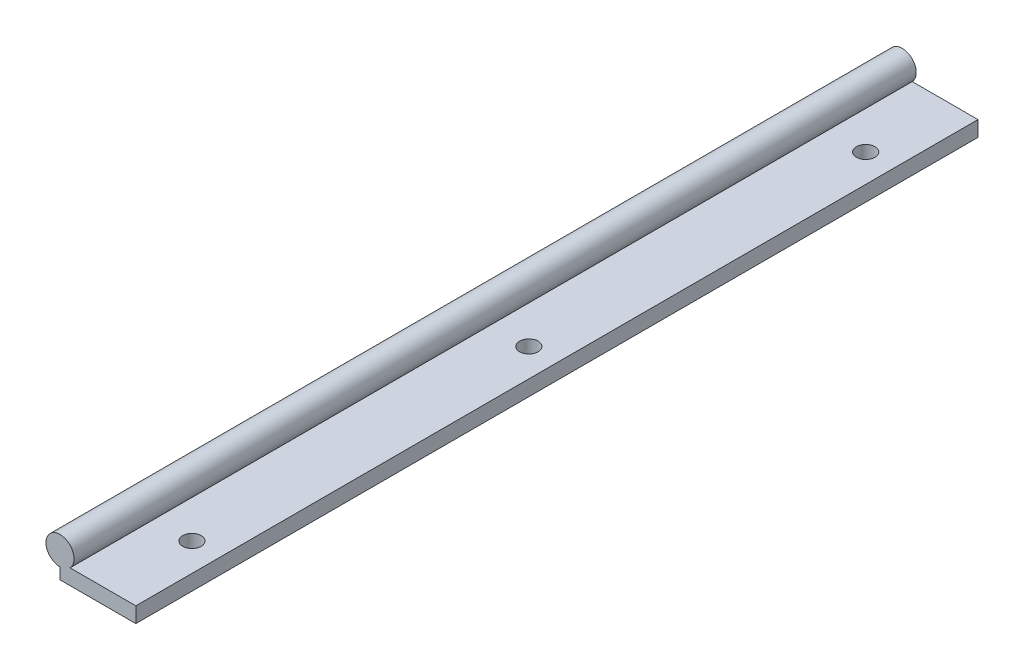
from build123d import *

# Parameters (mm, degrees)
EXTRUIR1_DEPTH                     = 300
TALADRO_DE_DI_METRO_DE_6_6_6_6_1_D = 6.6


with BuildPart() as part:
    # Croquis1 → Extruir1 (new body)
    with BuildSketch(Plane.XY):
        with BuildLine():
            Line((13.5, 2.75), (-9.929285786, 2.75))
            ThreePointArc((-9.929285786, 2.75), (-15.436491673, 10.859772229), (-13.5, 1.25))
            Line((-13.5, 1.25), (-13.5, -2.75))
            Line((-13.5, -2.75), (13.5, -2.75))
            Line((13.5, -2.75), (13.5, 2.75))
        make_face()
    extrude(amount=EXTRUIR1_DEPTH)

    # Taladro de di_metro de _6.6 _6.6_1 (through all)
    with Locations(Plane(origin=(3.5, 2.75, 270), x_dir=(1, 0, 0), z_dir=(0, 1, 0))):
        with Locations((0, 0), (0, 120), (0, 240)):
            Hole(TALADRO_DE_DI_METRO_DE_6_6_6_6_1_D / 2)


solid = part.part
